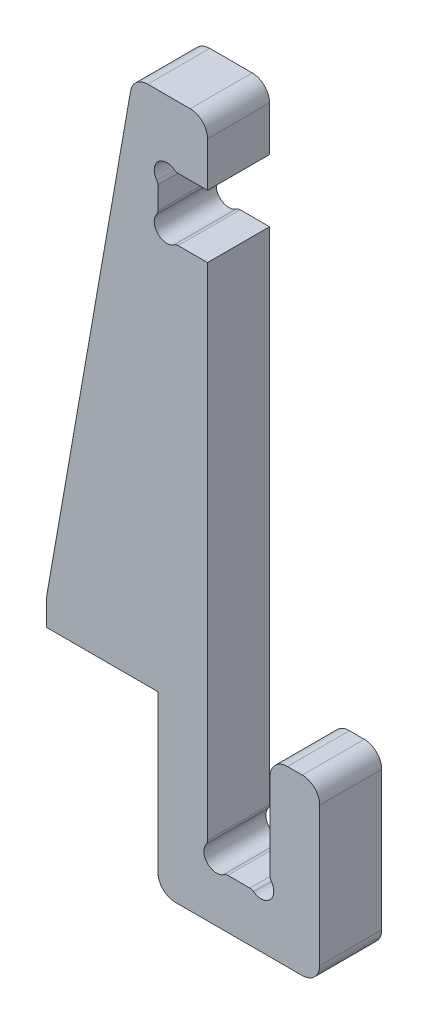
from build123d import *

# Parameters (mm, degrees)
BOSS_EXTRU_2_DEPTH = 25
CONG_1_R           = 7


with BuildPart() as part:
    # Esquisse2 → Boss.-Extru.2 (new body)
    with BuildSketch(Plane.XY):
        with BuildLine():
            Line((45.2, 70), (45.2, 28.131040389))
            ThreePointArc((45.2, 28.131040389), (45.326017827, 27.347325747), (45.691366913, 26.642620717))
            ThreePointArc((45.691366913, 26.642620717), (45.2, 20), (38.557379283, 19.508633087))
            ThreePointArc((38.557379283, 19.508633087), (37.852674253, 19.873982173), (37.068959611, 20))
            Line((37.068959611, 20), (28.131040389, 20))
            ThreePointArc((28.131040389, 20), (27.347325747, 19.873982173), (26.642620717, 19.508633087))
            ThreePointArc((26.642620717, 19.508633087), (20, 20), (19.508633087, 26.642620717))
            ThreePointArc((19.508633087, 26.642620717), (19.873982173, 27.347325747), (20, 28.131040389))
            Line((20, 28.131040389), (20, 229.8))
            Line((20, 229.8), (8.131040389, 229.8))
            ThreePointArc((8.131040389, 229.8), (7.347325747, 229.673982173), (6.642620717, 229.308633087))
            ThreePointArc((6.642620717, 229.308633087), (0, 229.8), (-0.491366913, 236.442620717))
            ThreePointArc((-0.491366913, 236.442620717), (-0.126017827, 237.147325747), (0, 237.931040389))
            Line((0, 237.931040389), (0, 246.868959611))
            ThreePointArc((0, 246.868959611), (-0.126017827, 247.652674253), (-0.491366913, 248.357379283))
            ThreePointArc((-0.491366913, 248.357379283), (0, 255), (6.642620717, 255.491366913))
            ThreePointArc((6.642620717, 255.491366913), (7.347325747, 255.126017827), (8.131040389, 255))
            Line((8.131040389, 255), (20, 255))
            Line((20, 255), (20, 280))
            Line((20, 280), (-10, 280))
            Line((-10, 280), (-45, 80))
            Line((-45, 80), (-45, 70))
            Line((-45, 70), (0, 70))
            Line((0, 70), (0, 0))
            Line((0, 0), (65.2, 0))
            Line((65.2, 0), (65.2, 70))
            Line((65.2, 70), (45.2, 70))
        make_face()
    extrude(amount=BOSS_EXTRU_2_DEPTH)

    # Cong_1
    cong_1_edges = [part.edges().sort_by_distance(p)[0] for p in [
        (45.2, 70, 12.5),
        (65.2, 70, 12.5),
        (65.2, 0, 12.5),
        (0, 0, 12.5),
        (-10, 280, 12.5),
        (20, 280, 12.5),
    ]]
    fillet(cong_1_edges, radius=CONG_1_R)


solid = part.part
